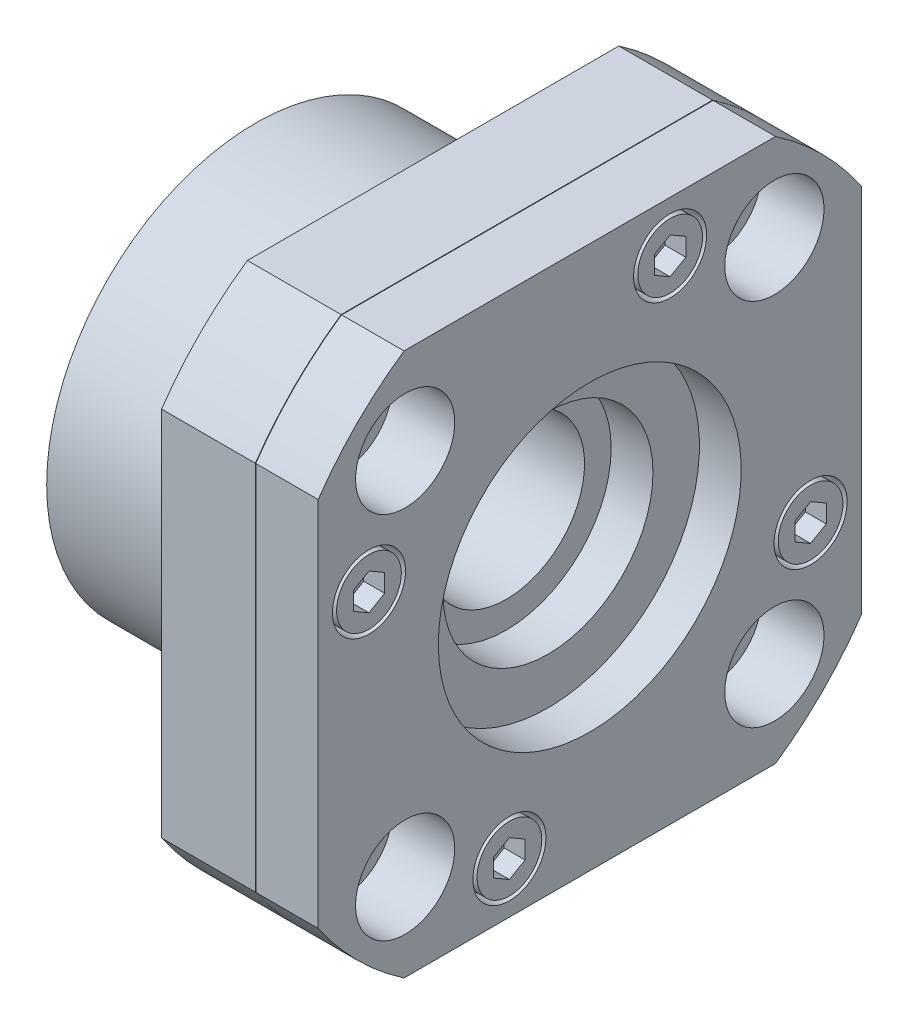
from build123d import *

# Parameters (mm, degrees)
BOSS_EXTRUDE1_DEPTH     = 15
CUT_EXTRUDE1_DEPTH      = 0.025
CUT_EXTRUDE1_DEPTH_BACK = 0.025
SKETCH9_R               = 3.5
SKETCH9_R_2             = 3.1
CUT_EXTRUDE2_DEPTH      = 4
SKETCH10_R              = 3.5
SKETCH10_R_2            = 3.1
CUT_EXTRUDE3_DEPTH      = 4
SKETCH11_R              = 3.5
SKETCH11_R_2            = 3.1
CUT_EXTRUDE4_DEPTH      = 4
SKETCH12_R              = 3.5
SKETCH12_R_2            = 3.1
CUT_EXTRUDE5_DEPTH      = 4
CUT_EXTRUDE6_DEPTH      = 2
CUT_EXTRUDE7_DEPTH      = 2
CUT_EXTRUDE8_DEPTH      = 2
CUT_EXTRUDE9_DEPTH      = 2


with BuildPart() as part:
    # Sketch1 → Revolve1 (revolve)
    with BuildSketch(Plane.XY, mode=Mode.PRIVATE) as revolve1_sk:
        with BuildLine():
            Line((0, 0), (0, 20))
            Line((0, 20), (16.7, 20))
            ThreePointArc((16.7, 20), (16.912132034, 20.087867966), (17, 20.3))
            Line((17, 20.3), (17, 0))
            Line((17, 0), (0, 0))
        make_face()
    revolve(revolve1_sk.sketch.rotate(Axis((17, 0, 0), (-1, 0, 0)), 270), axis=Axis((17, 0, 0), (-1, 0, 0)))

    # Sketch2 → Boss-Extrude1 (add)
    with BuildSketch(Plane(origin=(17, 0, 0), x_dir=(0, 0, -1), z_dir=(1, 0, 0))):
        with BuildLine():
            Line((-17.783419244, -26), (17.783419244, -26))
            ThreePointArc((17.783419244, -26), (22.273863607, -22.273863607), (26, -17.783419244))
            Line((26, -17.783419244), (26, 17.783419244))
            ThreePointArc((26, 17.783419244), (22.273863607, 22.273863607), (17.783419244, 26))
            Line((17.783419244, 26), (-17.783419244, 26))
            ThreePointArc((-17.783419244, 26), (-22.273863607, 22.273863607), (-26, 17.783419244))
            Line((-26, 17.783419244), (-26, -17.783419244))
            ThreePointArc((-26, -17.783419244), (-22.273863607, -22.273863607), (-17.783419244, -26))
        make_face()
    extrude(amount=BOSS_EXTRUDE1_DEPTH)

    # Sketch3 → Cut-Revolve1 (revolve, cut)
    with BuildSketch(Plane.XY, mode=Mode.PRIVATE) as cut_revolve1_sk:
        Polygon((0, 0), (0, 14.5), (2, 14.5), (2, 10.05), (6, 10.05), (6, 7.5), (24, 7.5), (24, 10.05), (28, 10.05), (28, 14.5), (32, 14.5), (32, 0), align=None)
    revolve(cut_revolve1_sk.sketch.rotate(Axis((32, 0, 0), (-1, 0, 0)), 270), axis=Axis((32, 0, 0), (-1, 0, 0)), mode=Mode.SUBTRACT)

    # Sketch4 → Cut-Revolve2 (revolve, cut)
    with BuildSketch(Plane(origin=(0, -17.67766953, 17.67766953), x_dir=(-1, 0, 0), z_dir=(0, -0.7071067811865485, 0.7071067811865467)), mode=Mode.PRIVATE) as cut_revolve2_sk:
        Polygon((-17, 0), (-17, -2.75), (-26, -2.75), (-26, -4.75), (-32, -4.75), (-32, 0), align=None)
    revolve(cut_revolve2_sk.sketch.rotate(Axis((32, -17.67766953, 17.67766953), (-1, 0, 0)), 315), axis=Axis((32, -17.67766953, 17.67766953), (-1, 0, 0)), mode=Mode.SUBTRACT)

    # Sketch5 → Cut-Revolve3 (revolve, cut)
    with BuildSketch(Plane(origin=(0, 0, 0), x_dir=(1, 0, 0), z_dir=(0, -0.7071067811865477, 0.7071067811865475)), mode=Mode.PRIVATE) as cut_revolve3_sk:
        Polygon((17, 25), (17, 27.75), (26, 27.75), (26, 29.75), (32, 29.75), (32, 25), align=None)
    revolve(cut_revolve3_sk.sketch.rotate(Axis((32, 17.67766953, 17.67766953), (-1, 0, 0)), 315), axis=Axis((32, 17.67766953, 17.67766953), (-1, 0, 0)), mode=Mode.SUBTRACT)

    # Sketch6 → Cut-Revolve4 (revolve, cut)
    with BuildSketch(Plane(origin=(0, 17.67766953, -17.67766953), x_dir=(1, 0, 0), z_dir=(0, -0.7071067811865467, 0.7071067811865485)), mode=Mode.PRIVATE) as cut_revolve4_sk:
        Polygon((17, 0), (17, 2.75), (26, 2.75), (26, 4.75), (32, 4.75), (32, 0), align=None)
    revolve(cut_revolve4_sk.sketch.rotate(Axis((32, 17.67766953, -17.67766953), (-1, 0, 0)), 315), axis=Axis((32, 17.67766953, -17.67766953), (-1, 0, 0)), mode=Mode.SUBTRACT)

    # Sketch7 → Cut-Revolve5 (revolve, cut)
    with BuildSketch(Plane(origin=(0, 0, 0), x_dir=(1, 0, 0), z_dir=(0, -0.7071067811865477, 0.7071067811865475)), mode=Mode.PRIVATE) as cut_revolve5_sk:
        Polygon((17, -25), (17, -22.25), (26, -22.25), (26, -20.25), (32, -20.25), (32, -25), align=None)
    revolve(cut_revolve5_sk.sketch.rotate(Axis((32, -17.67766953, -17.67766953), (-1, 0, 0)), 315), axis=Axis((32, -17.67766953, -17.67766953), (-1, 0, 0)), mode=Mode.SUBTRACT)

    # Sketch8 → Cut-Extrude1 (cut, two sides: drawn at the far end of the back side and taken through both)
    with BuildSketch(Plane(origin=(26, 0, 0), x_dir=(0, 0, -1), z_dir=(1, 0, 0)).offset(-CUT_EXTRUDE1_DEPTH_BACK)):
        with BuildLine():
            Line((-17.783419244, -26), (17.783419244, -26))
            ThreePointArc((17.783419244, -26), (22.273863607, -22.273863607), (26, -17.783419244))
            Line((26, -17.783419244), (26, 17.783419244))
            ThreePointArc((26, 17.783419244), (22.273863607, 22.273863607), (17.783419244, 26))
            Line((17.783419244, 26), (-17.783419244, 26))
            ThreePointArc((-17.783419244, 26), (-22.273863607, 22.273863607), (-26, 17.783419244))
            Line((-26, 17.783419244), (-26, -17.783419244))
            ThreePointArc((-26, -17.783419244), (-22.273863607, -22.273863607), (-17.783419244, -26))
        make_face()
        with BuildLine():
            Line((-17.767948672, -25.95), (17.767948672, -25.95))
            ThreePointArc((17.767948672, -25.95), (22.238508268, -22.238508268), (25.95, -17.767948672))
            Line((25.95, -17.767948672), (25.95, 17.767948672))
            ThreePointArc((25.95, 17.767948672), (22.238508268, 22.238508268), (17.767948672, 25.95))
            Line((17.767948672, 25.95), (-17.767948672, 25.95))
            ThreePointArc((-17.767948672, 25.95), (-22.238508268, 22.238508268), (-25.95, 17.767948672))
            Line((-25.95, 17.767948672), (-25.95, -17.767948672))
            ThreePointArc((-25.95, -17.767948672), (-22.238508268, -22.238508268), (-17.767948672, -25.95))
        make_face(mode=Mode.SUBTRACT)
    extrude(amount=CUT_EXTRUDE1_DEPTH + CUT_EXTRUDE1_DEPTH_BACK, mode=Mode.SUBTRACT)

    # Sketch9 → Cut-Extrude2 (cut)
    with BuildSketch(Plane(origin=(32, 0, 0), x_dir=(0, 0, -1), z_dir=(1, 0, 0))):
        with Locations((-21.143083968, 7.695453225)):
            Circle(SKETCH9_R)
        with Locations((-21.143083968, 7.695453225)):
            Circle(SKETCH9_R_2, mode=Mode.SUBTRACT)
    extrude(amount=-CUT_EXTRUDE2_DEPTH, mode=Mode.SUBTRACT)

    # Sketch10 → Cut-Extrude3 (cut)
    with BuildSketch(Plane(origin=(32, 0, 0), x_dir=(0, 0, -1), z_dir=(1, 0, 0))):
        with Locations((-7.695453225, -21.143083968)):
            Circle(SKETCH10_R)
        with Locations((-7.695453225, -21.143083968)):
            Circle(SKETCH10_R_2, mode=Mode.SUBTRACT)
    extrude(amount=-CUT_EXTRUDE3_DEPTH, mode=Mode.SUBTRACT)

    # Sketch11 → Cut-Extrude4 (cut)
    with BuildSketch(Plane(origin=(32, 0, 0), x_dir=(0, 0, -1), z_dir=(1, 0, 0))):
        with Locations((21.143083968, -7.695453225)):
            Circle(SKETCH11_R)
        with Locations((21.143083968, -7.695453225)):
            Circle(SKETCH11_R_2, mode=Mode.SUBTRACT)
    extrude(amount=-CUT_EXTRUDE4_DEPTH, mode=Mode.SUBTRACT)

    # Sketch12 → Cut-Extrude5 (cut)
    with BuildSketch(Plane(origin=(32, 0, 0), x_dir=(0, 0, -1), z_dir=(1, 0, 0))):
        with Locations((7.695453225, 21.143083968)):
            Circle(SKETCH12_R)
        with Locations((7.695453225, 21.143083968)):
            Circle(SKETCH12_R_2, mode=Mode.SUBTRACT)
    extrude(amount=-CUT_EXTRUDE5_DEPTH, mode=Mode.SUBTRACT)

    # Sketch13 → Cut-Extrude6 (cut)
    with BuildSketch(Plane(origin=(32, 0, 0), x_dir=(0, 0, -1), z_dir=(1, 0, 0))):
        Polygon((-22.643083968, 8.561478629), (-22.643083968, 6.829427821), (-21.143083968, 5.963402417), (-19.643083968, 6.829427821), (-19.643083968, 8.561478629), (-21.143083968, 9.427504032), align=None)
    extrude(amount=-CUT_EXTRUDE6_DEPTH, mode=Mode.SUBTRACT)

    # Sketch14 → Cut-Extrude7 (cut)
    with BuildSketch(Plane(origin=(32, 0, 0), x_dir=(0, 0, -1), z_dir=(1, 0, 0))):
        Polygon((-9.195453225, -20.277058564), (-9.195453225, -22.009109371), (-7.695453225, -22.875134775), (-6.195453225, -22.009109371), (-6.195453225, -20.277058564), (-7.695453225, -19.41103316), align=None)
    extrude(amount=-CUT_EXTRUDE7_DEPTH, mode=Mode.SUBTRACT)

    # Sketch15 → Cut-Extrude8 (cut)
    with BuildSketch(Plane(origin=(32, 0, 0), x_dir=(0, 0, -1), z_dir=(1, 0, 0))):
        Polygon((19.643083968, -6.829427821), (19.643083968, -8.561478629), (21.143083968, -9.427504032), (22.643083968, -8.561478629), (22.643083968, -6.829427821), (21.143083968, -5.963402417), align=None)
    extrude(amount=-CUT_EXTRUDE8_DEPTH, mode=Mode.SUBTRACT)

    # Sketch16 → Cut-Extrude9 (cut)
    with BuildSketch(Plane(origin=(32, 0, 0), x_dir=(0, 0, -1), z_dir=(1, 0, 0))):
        Polygon((6.195453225, 22.009109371), (6.195453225, 20.277058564), (7.695453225, 19.41103316), (9.195453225, 20.277058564), (9.195453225, 22.009109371), (7.695453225, 22.875134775), align=None)
    extrude(amount=-CUT_EXTRUDE9_DEPTH, mode=Mode.SUBTRACT)


solid = part.part
